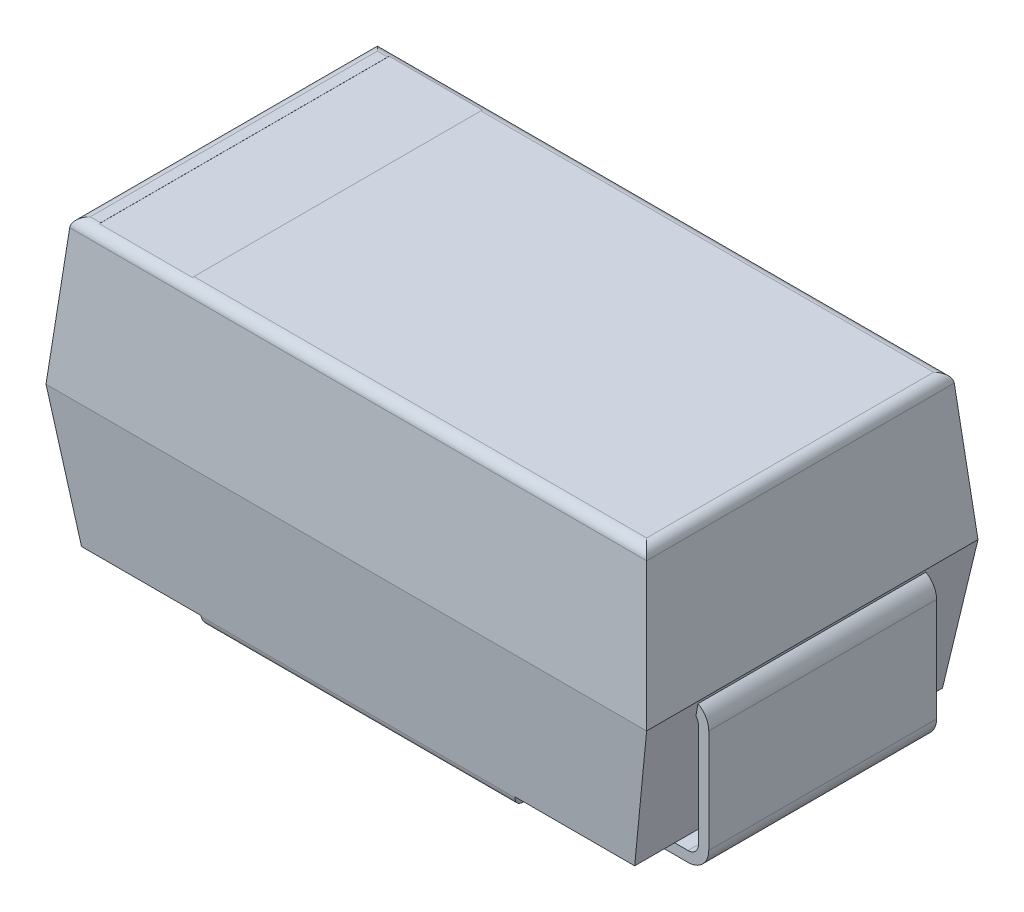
ISO-10303-21;
HEADER;
FILE_DESCRIPTION(('STEP AP214'),'2;1');
FILE_NAME('part.step','',(''),(''),'','','');
FILE_SCHEMA(('AUTOMOTIVE_DESIGN { 1 0 10303 214 1 1 1 1 }'));
ENDSEC;
DATA;
#1=APPLICATION_CONTEXT('core data for automotive mechanical design processes');
#2=APPLICATION_PROTOCOL_DEFINITION('international standard','automotive_design',2000,#1);
#3=PRODUCT_CONTEXT('',#1,'mechanical');
#4=PRODUCT('Part','Part','',(#3));
#5=PRODUCT_RELATED_PRODUCT_CATEGORY('part','',(#4));
#6=PRODUCT_DEFINITION_FORMATION('','',#4);
#7=PRODUCT_DEFINITION_CONTEXT('part definition',#1,'design');
#8=PRODUCT_DEFINITION('design','',#6,#7);
#9=PRODUCT_DEFINITION_SHAPE('','',#8);
#10=(LENGTH_UNIT() NAMED_UNIT(*) SI_UNIT(.MILLI.,.METRE.));
#11=(NAMED_UNIT(*) PLANE_ANGLE_UNIT() SI_UNIT($,.RADIAN.));
#12=(NAMED_UNIT(*) SI_UNIT($,.STERADIAN.) SOLID_ANGLE_UNIT());
#13=UNCERTAINTY_MEASURE_WITH_UNIT(LENGTH_MEASURE(1.E-05),#10,'distance_accuracy_value','');
#14=(GEOMETRIC_REPRESENTATION_CONTEXT(3) GLOBAL_UNCERTAINTY_ASSIGNED_CONTEXT((#13)) GLOBAL_UNIT_ASSIGNED_CONTEXT((#10,
#11,#12)) REPRESENTATION_CONTEXT('',''));
#15=CARTESIAN_POINT('',(0.,0.,0.));
#16=DIRECTION('',(0.,0.,1.));
#17=DIRECTION('',(1.,0.,0.));
#18=AXIS2_PLACEMENT_3D('',#15,#16,#17);
#19=CARTESIAN_POINT('',(2.68588275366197,2.8,1.6));
#20=DIRECTION('',(0.,-1.,0.));
#21=DIRECTION('',(0.,0.,-1.));
#22=AXIS2_PLACEMENT_3D('',#19,#20,#21);
#23=PLANE('',#22);
#24=DIRECTION('',(1.,0.,0.));
#25=VECTOR('',#24,1.);
#26=CARTESIAN_POINT('',(-3.,2.8,1.38588275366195));
#27=LINE('',#26,#25);
#28=CARTESIAN_POINT('',(-2.68588275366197,2.8,1.38588275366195));
#29=VERTEX_POINT('',#28);
#30=CARTESIAN_POINT('',(-2.58588275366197,2.8,1.38588275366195));
#31=VERTEX_POINT('',#30);
#32=EDGE_CURVE('E333',#29,#31,#27,.T.);
#33=ORIENTED_EDGE('',*,*,#32,.T.);
#34=DIRECTION('',(0.,0.,1.));
#35=VECTOR('',#34,1.);
#36=CARTESIAN_POINT('',(-2.58588275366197,2.8,-1.6));
#37=LINE('',#36,#35);
#38=CARTESIAN_POINT('',(-2.58588275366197,2.8,-1.38588275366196));
#39=VERTEX_POINT('',#38);
#40=EDGE_CURVE('E310',#39,#31,#37,.T.);
#41=ORIENTED_EDGE('',*,*,#40,.F.);
#42=DIRECTION('',(1.,0.,0.));
#43=VECTOR('',#42,1.);
#44=CARTESIAN_POINT('',(-3.,2.8,-1.38588275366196));
#45=LINE('',#44,#43);
#46=CARTESIAN_POINT('',(-2.68588275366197,2.8,-1.38588275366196));
#47=VERTEX_POINT('',#46);
#48=EDGE_CURVE('E337',#47,#39,#45,.T.);
#49=ORIENTED_EDGE('',*,*,#48,.F.);
#50=DIRECTION('',(0.,0.,-1.));
#51=VECTOR('',#50,1.);
#52=CARTESIAN_POINT('',(-2.68588275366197,2.8,1.6));
#53=LINE('',#52,#51);
#54=EDGE_CURVE('E396',#29,#47,#53,.T.);
#55=ORIENTED_EDGE('',*,*,#54,.F.);
#56=EDGE_LOOP('',(#33,#41,#49,#55));
#57=FACE_BOUND('',#56,.T.);
#58=ADVANCED_FACE('F34',(#57),#23,.F.);
#59=CARTESIAN_POINT('',(-2.9,1.4,1.6));
#60=DIRECTION('',(0.984807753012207,0.173648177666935,0.));
#61=DIRECTION('',(-0.173648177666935,0.984807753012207,0.));
#62=AXIS2_PLACEMENT_3D('',#59,#60,#61);
#63=PLANE('',#62);
#64=DIRECTION('',(0.,0.,-1.));
#65=VECTOR('',#64,1.);
#66=CARTESIAN_POINT('',(-2.89570064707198,1.37561715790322,1.1));
#67=LINE('',#66,#65);
#68=CARTESIAN_POINT('',(-2.89570064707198,1.37561715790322,-1.1));
#69=VERTEX_POINT('',#68);
#70=CARTESIAN_POINT('',(-2.89570064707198,1.37561715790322,1.1));
#71=VERTEX_POINT('',#70);
#72=EDGE_CURVE('E437',#69,#71,#67,.F.);
#73=ORIENTED_EDGE('',*,*,#72,.T.);
#74=DIRECTION('',(0.173648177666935,-0.984807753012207,0.));
#75=VECTOR('',#74,1.);
#76=CARTESIAN_POINT('',(-2.69177254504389,0.219083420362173,1.1));
#77=LINE('',#76,#75);
#78=CARTESIAN_POINT('',(-2.87616118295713,1.26480335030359,1.1));
#79=VERTEX_POINT('',#78);
#80=EDGE_CURVE('E441',#71,#79,#77,.T.);
#81=ORIENTED_EDGE('',*,*,#80,.T.);
#82=DIRECTION('',(0.,0.,-1.));
#83=VECTOR('',#82,1.);
#84=CARTESIAN_POINT('',(-2.87616118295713,1.26480335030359,1.1));
#85=LINE('',#84,#83);
#86=CARTESIAN_POINT('',(-2.87616118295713,1.26480335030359,-1.1));
#87=VERTEX_POINT('',#86);
#88=EDGE_CURVE('E439',#79,#87,#85,.T.);
#89=ORIENTED_EDGE('',*,*,#88,.T.);
#90=DIRECTION('',(0.173648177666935,-0.984807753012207,0.));
#91=VECTOR('',#90,1.);
#92=CARTESIAN_POINT('',(-2.69177254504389,0.219083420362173,-1.1));
#93=LINE('',#92,#91);
#94=EDGE_CURVE('E578',#69,#87,#93,.T.);
#95=ORIENTED_EDGE('',*,*,#94,.F.);
#96=EDGE_LOOP('',(#73,#81,#89,#95));
#97=FACE_BOUND('',#96,.T.);
#98=DIRECTION('',(-0.173007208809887,0.981172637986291,-0.0858414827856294));
#99=VECTOR('',#98,1.);
#100=CARTESIAN_POINT('',(-2.8524761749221,1.13047899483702,-1.57641996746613));
#101=LINE('',#100,#99);
#102=CARTESIAN_POINT('',(-2.67077492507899,0.0999999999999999,-1.48626473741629));
#103=VERTEX_POINT('',#102);
#104=CARTESIAN_POINT('',(-2.9,1.4,-1.6));
#105=VERTEX_POINT('',#104);
#106=EDGE_CURVE('E358',#103,#105,#101,.T.);
#107=ORIENTED_EDGE('',*,*,#106,.F.);
#108=DIRECTION('',(0.,0.,-1.));
#109=VECTOR('',#108,1.);
#110=CARTESIAN_POINT('',(-2.67077492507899,0.0999999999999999,1.6));
#111=LINE('',#110,#109);
#112=CARTESIAN_POINT('',(-2.67077492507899,0.0999999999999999,-1.1));
#113=VERTEX_POINT('',#112);
#114=EDGE_CURVE('E424',#113,#103,#111,.T.);
#115=ORIENTED_EDGE('',*,*,#114,.F.);
#116=CARTESIAN_POINT('',(-2.67077492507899,0.0999999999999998,1.1));
#117=VERTEX_POINT('',#116);
#118=EDGE_CURVE('E428',#117,#113,#111,.T.);
#119=ORIENTED_EDGE('',*,*,#118,.F.);
#120=CARTESIAN_POINT('',(-2.67077492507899,0.0999999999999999,1.48626473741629));
#121=VERTEX_POINT('',#120);
#122=EDGE_CURVE('E425',#121,#117,#111,.T.);
#123=ORIENTED_EDGE('',*,*,#122,.F.);
#124=DIRECTION('',(0.173007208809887,-0.98117263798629,-0.085841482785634));
#125=VECTOR('',#124,1.);
#126=CARTESIAN_POINT('',(-2.9,1.4,1.6));
#127=LINE('',#126,#125);
#128=CARTESIAN_POINT('',(-2.9,1.4,1.6));
#129=VERTEX_POINT('',#128);
#130=EDGE_CURVE('E375',#129,#121,#127,.T.);
#131=ORIENTED_EDGE('',*,*,#130,.F.);
#132=DIRECTION('',(0.,0.,-1.));
#133=VECTOR('',#132,1.);
#134=CARTESIAN_POINT('',(-2.9,1.4,1.6));
#135=LINE('',#134,#133);
#136=EDGE_CURVE('E390',#129,#105,#135,.T.);
#137=ORIENTED_EDGE('',*,*,#136,.T.);
#138=EDGE_LOOP('',(#107,#115,#119,#123,#131,#137));
#139=FACE_BOUND('',#138,.T.);
#140=ADVANCED_FACE('F658',(#97,#139),#63,.F.);
#141=CARTESIAN_POINT('',(-2.67077492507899,0.0999999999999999,1.6));
#142=DIRECTION('',(0.,1.,0.));
#143=DIRECTION('',(-1.,0.,0.));
#144=AXIS2_PLACEMENT_3D('',#141,#142,#143);
#145=PLANE('',#144);
#146=DIRECTION('',(-1.,0.,0.));
#147=VECTOR('',#146,1.);
#148=CARTESIAN_POINT('',(-2.67077492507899,0.0999999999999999,-1.48626473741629));
#149=LINE('',#148,#147);
#150=CARTESIAN_POINT('',(-1.51763269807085,0.0999999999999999,-1.48626473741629));
#151=VERTEX_POINT('',#150);
#152=EDGE_CURVE('E356',#151,#103,#149,.T.);
#153=ORIENTED_EDGE('',*,*,#152,.F.);
#154=DIRECTION('',(0.,0.,-1.));
#155=VECTOR('',#154,1.);
#156=CARTESIAN_POINT('',(-1.51763269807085,0.0999999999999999,1.6));
#157=LINE('',#156,#155);
#158=CARTESIAN_POINT('',(-1.51763269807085,0.0999999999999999,1.48626473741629));
#159=VERTEX_POINT('',#158);
#160=EDGE_CURVE('E421',#159,#151,#157,.T.);
#161=ORIENTED_EDGE('',*,*,#160,.F.);
#162=DIRECTION('',(1.,0.,0.));
#163=VECTOR('',#162,1.);
#164=CARTESIAN_POINT('',(-2.67077492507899,0.0999999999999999,1.48626473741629));
#165=LINE('',#164,#163);
#166=EDGE_CURVE('E373',#121,#159,#165,.T.);
#167=ORIENTED_EDGE('',*,*,#166,.F.);
#168=ORIENTED_EDGE('',*,*,#122,.T.);
#169=DIRECTION('',(-1.,0.,0.));
#170=VECTOR('',#169,1.);
#171=CARTESIAN_POINT('',(-1.7,0.0999999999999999,1.1));
#172=LINE('',#171,#170);
#173=CARTESIAN_POINT('',(-1.7,0.0999999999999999,1.1));
#174=VERTEX_POINT('',#173);
#175=EDGE_CURVE('E448',#174,#117,#172,.T.);
#176=ORIENTED_EDGE('',*,*,#175,.F.);
#177=DIRECTION('',(0.,0.,-1.));
#178=VECTOR('',#177,1.);
#179=CARTESIAN_POINT('',(-1.7,0.0999999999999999,1.1));
#180=LINE('',#179,#178);
#181=CARTESIAN_POINT('',(-1.7,0.0999999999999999,-1.1));
#182=VERTEX_POINT('',#181);
#183=EDGE_CURVE('E572',#174,#182,#180,.T.);
#184=ORIENTED_EDGE('',*,*,#183,.T.);
#185=DIRECTION('',(-1.,0.,0.));
#186=VECTOR('',#185,1.);
#187=CARTESIAN_POINT('',(-1.7,0.0999999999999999,-1.1));
#188=LINE('',#187,#186);
#189=EDGE_CURVE('E490',#182,#113,#188,.T.);
#190=ORIENTED_EDGE('',*,*,#189,.T.);
#191=ORIENTED_EDGE('',*,*,#114,.T.);
#192=EDGE_LOOP('',(#153,#161,#167,#168,#176,#184,#190,#191));
#193=FACE_BOUND('',#192,.T.);
#194=ADVANCED_FACE('F652',(#193),#145,.F.);
#195=CARTESIAN_POINT('',(2.67077492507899,0.0999999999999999,1.6));
#196=DIRECTION('',(0.,1.,0.));
#197=DIRECTION('',(-1.,0.,0.));
#198=AXIS2_PLACEMENT_3D('',#195,#196,#197);
#199=PLANE('',#198);
#200=DIRECTION('',(-1.,0.,0.));
#201=VECTOR('',#200,1.);
#202=CARTESIAN_POINT('',(2.67077492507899,0.0999999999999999,-1.48626473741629));
#203=LINE('',#202,#201);
#204=CARTESIAN_POINT('',(2.67077492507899,0.0999999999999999,-1.48626473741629));
#205=VERTEX_POINT('',#204);
#206=CARTESIAN_POINT('',(1.51763269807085,0.0999999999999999,-1.48626473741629));
#207=VERTEX_POINT('',#206);
#208=EDGE_CURVE('E350',#205,#207,#203,.T.);
#209=ORIENTED_EDGE('',*,*,#208,.F.);
#210=DIRECTION('',(0.,0.,-1.));
#211=VECTOR('',#210,1.);
#212=CARTESIAN_POINT('',(2.67077492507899,0.0999999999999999,1.6));
#213=LINE('',#212,#211);
#214=CARTESIAN_POINT('',(2.67077492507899,0.0999999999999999,-1.1));
#215=VERTEX_POINT('',#214);
#216=EDGE_CURVE('E408',#215,#205,#213,.T.);
#217=ORIENTED_EDGE('',*,*,#216,.F.);
#218=DIRECTION('',(-1.,0.,0.));
#219=VECTOR('',#218,1.);
#220=CARTESIAN_POINT('',(1.7,0.0999999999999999,-1.1));
#221=LINE('',#220,#219);
#222=CARTESIAN_POINT('',(1.7,0.0999999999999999,-1.1));
#223=VERTEX_POINT('',#222);
#224=EDGE_CURVE('E506',#215,#223,#221,.T.);
#225=ORIENTED_EDGE('',*,*,#224,.T.);
#226=DIRECTION('',(0.,0.,-1.));
#227=VECTOR('',#226,1.);
#228=CARTESIAN_POINT('',(1.7,0.0999999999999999,1.1));
#229=LINE('',#228,#227);
#230=CARTESIAN_POINT('',(1.7,0.0999999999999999,1.1));
#231=VERTEX_POINT('',#230);
#232=EDGE_CURVE('E551',#231,#223,#229,.T.);
#233=ORIENTED_EDGE('',*,*,#232,.F.);
#234=DIRECTION('',(1.,0.,0.));
#235=VECTOR('',#234,1.);
#236=CARTESIAN_POINT('',(-2.8,0.0999999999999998,1.1));
#237=LINE('',#236,#235);
#238=CARTESIAN_POINT('',(2.67077492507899,0.0999999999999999,1.1));
#239=VERTEX_POINT('',#238);
#240=EDGE_CURVE('E434',#231,#239,#237,.T.);
#241=ORIENTED_EDGE('',*,*,#240,.T.);
#242=CARTESIAN_POINT('',(2.67077492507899,0.0999999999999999,1.48626473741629));
#243=VERTEX_POINT('',#242);
#244=EDGE_CURVE('E409',#243,#239,#213,.T.);
#245=ORIENTED_EDGE('',*,*,#244,.F.);
#246=DIRECTION('',(1.,0.,0.));
#247=VECTOR('',#246,1.);
#248=CARTESIAN_POINT('',(2.67077492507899,0.0999999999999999,1.48626473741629));
#249=LINE('',#248,#247);
#250=CARTESIAN_POINT('',(1.51763269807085,0.0999999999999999,1.48626473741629));
#251=VERTEX_POINT('',#250);
#252=EDGE_CURVE('E367',#251,#243,#249,.T.);
#253=ORIENTED_EDGE('',*,*,#252,.F.);
#254=DIRECTION('',(0.,0.,-1.));
#255=VECTOR('',#254,1.);
#256=CARTESIAN_POINT('',(1.51763269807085,0.0999999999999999,1.6));
#257=LINE('',#256,#255);
#258=EDGE_CURVE('E411',#251,#207,#257,.T.);
#259=ORIENTED_EDGE('',*,*,#258,.T.);
#260=EDGE_LOOP('',(#209,#217,#225,#233,#241,#245,#253,#259));
#261=FACE_BOUND('',#260,.T.);
#262=ADVANCED_FACE('F621',(#261),#199,.F.);
#263=CARTESIAN_POINT('',(2.9,1.4,1.6));
#264=DIRECTION('',(-0.984807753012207,0.173648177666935,0.));
#265=DIRECTION('',(-0.173648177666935,-0.984807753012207,0.));
#266=AXIS2_PLACEMENT_3D('',#263,#264,#265);
#267=PLANE('',#266);
#268=DIRECTION('',(0.,0.,-1.));
#269=VECTOR('',#268,1.);
#270=CARTESIAN_POINT('',(2.87616118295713,1.26480335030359,1.1));
#271=LINE('',#270,#269);
#272=CARTESIAN_POINT('',(2.87616118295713,1.26480335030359,-1.1));
#273=VERTEX_POINT('',#272);
#274=CARTESIAN_POINT('',(2.87616118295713,1.26480335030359,1.1));
#275=VERTEX_POINT('',#274);
#276=EDGE_CURVE('E430',#273,#275,#271,.F.);
#277=ORIENTED_EDGE('',*,*,#276,.T.);
#278=DIRECTION('',(0.173648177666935,0.984807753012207,0.));
#279=VECTOR('',#278,1.);
#280=CARTESIAN_POINT('',(2.52291188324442,-0.738572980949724,1.1));
#281=LINE('',#280,#279);
#282=CARTESIAN_POINT('',(2.89570064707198,1.37561715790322,1.1));
#283=VERTEX_POINT('',#282);
#284=EDGE_CURVE('E432',#275,#283,#281,.T.);
#285=ORIENTED_EDGE('',*,*,#284,.T.);
#286=DIRECTION('',(0.,0.,-1.));
#287=VECTOR('',#286,1.);
#288=CARTESIAN_POINT('',(2.89570064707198,1.37561715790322,1.1));
#289=LINE('',#288,#287);
#290=CARTESIAN_POINT('',(2.89570064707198,1.37561715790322,-1.1));
#291=VERTEX_POINT('',#290);
#292=EDGE_CURVE('E427',#283,#291,#289,.T.);
#293=ORIENTED_EDGE('',*,*,#292,.T.);
#294=DIRECTION('',(0.173648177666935,0.984807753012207,0.));
#295=VECTOR('',#294,1.);
#296=CARTESIAN_POINT('',(2.52291188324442,-0.738572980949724,-1.1));
#297=LINE('',#296,#295);
#298=EDGE_CURVE('E575',#273,#291,#297,.T.);
#299=ORIENTED_EDGE('',*,*,#298,.F.);
#300=EDGE_LOOP('',(#277,#285,#293,#299));
#301=FACE_BOUND('',#300,.T.);
#302=DIRECTION('',(-0.173007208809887,-0.981172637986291,0.0858414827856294));
#303=VECTOR('',#302,1.);
#304=CARTESIAN_POINT('',(2.8524761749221,1.13047899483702,-1.57641996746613));
#305=LINE('',#304,#303);
#306=CARTESIAN_POINT('',(2.9,1.4,-1.6));
#307=VERTEX_POINT('',#306);
#308=EDGE_CURVE('E352',#307,#205,#305,.T.);
#309=ORIENTED_EDGE('',*,*,#308,.F.);
#310=DIRECTION('',(0.,0.,-1.));
#311=VECTOR('',#310,1.);
#312=CARTESIAN_POINT('',(2.9,1.4,1.6));
#313=LINE('',#312,#311);
#314=CARTESIAN_POINT('',(2.9,1.4,1.6));
#315=VERTEX_POINT('',#314);
#316=EDGE_CURVE('E405',#315,#307,#313,.T.);
#317=ORIENTED_EDGE('',*,*,#316,.F.);
#318=DIRECTION('',(0.173007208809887,0.98117263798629,0.085841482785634));
#319=VECTOR('',#318,1.);
#320=CARTESIAN_POINT('',(2.9,1.4,1.6));
#321=LINE('',#320,#319);
#322=EDGE_CURVE('E369',#243,#315,#321,.T.);
#323=ORIENTED_EDGE('',*,*,#322,.F.);
#324=ORIENTED_EDGE('',*,*,#244,.T.);
#325=EDGE_CURVE('E412',#239,#215,#213,.T.);
#326=ORIENTED_EDGE('',*,*,#325,.T.);
#327=ORIENTED_EDGE('',*,*,#216,.T.);
#328=EDGE_LOOP('',(#309,#317,#323,#324,#326,#327));
#329=FACE_BOUND('',#328,.T.);
#330=ADVANCED_FACE('F611',(#301,#329),#267,.F.);
#331=CARTESIAN_POINT('',(-1.51763269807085,0.0999999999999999,1.6));
#332=DIRECTION('',(0.984807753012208,0.173648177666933,0.));
#333=DIRECTION('',(-0.173648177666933,0.984807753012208,0.));
#334=AXIS2_PLACEMENT_3D('',#331,#332,#333);
#335=PLANE('',#334);
#336=DIRECTION('',(-0.173007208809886,0.981172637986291,-0.0858414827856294));
#337=VECTOR('',#336,1.);
#338=CARTESIAN_POINT('',(-1.47179797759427,-0.159941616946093,-1.46352279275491));
#339=LINE('',#338,#337);
#340=CARTESIAN_POINT('',(-1.51609590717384,0.0912844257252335,-1.48550222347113));
#341=VERTEX_POINT('',#340);
#342=EDGE_CURVE('E354',#341,#151,#339,.T.);
#343=ORIENTED_EDGE('',*,*,#342,.F.);
#344=CARTESIAN_POINT('',(-1.51763269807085,0.0999999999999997,-1.38588275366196));
#345=DIRECTION('',(0.984807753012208,0.173648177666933,0.));
#346=DIRECTION('',(0.173648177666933,-0.984807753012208,0.));
#347=AXIS2_PLACEMENT_3D('',#344,#345,#346);
#348=ELLIPSE('',#347,0.101542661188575,0.1);
#349=CARTESIAN_POINT('',(-1.5,0.,-1.38588275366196));
#350=VERTEX_POINT('',#349);
#351=EDGE_CURVE('E388',#350,#341,#348,.T.);
#352=ORIENTED_EDGE('',*,*,#351,.F.);
#353=DIRECTION('',(0.,0.,-1.));
#354=VECTOR('',#353,1.);
#355=CARTESIAN_POINT('',(-1.5,0.,1.6));
#356=LINE('',#355,#354);
#357=CARTESIAN_POINT('',(-1.5,0.,1.38588275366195));
#358=VERTEX_POINT('',#357);
#359=EDGE_CURVE('E418',#358,#350,#356,.T.);
#360=ORIENTED_EDGE('',*,*,#359,.F.);
#361=CARTESIAN_POINT('',(-1.51763269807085,0.0999999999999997,1.38588275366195));
#362=DIRECTION('',(0.984807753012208,0.173648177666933,0.));
#363=DIRECTION('',(0.173648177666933,-0.984807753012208,0.));
#364=AXIS2_PLACEMENT_3D('',#361,#362,#363);
#365=ELLIPSE('',#364,0.101542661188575,0.1);
#366=CARTESIAN_POINT('',(-1.51609590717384,0.0912844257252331,1.48550222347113));
#367=VERTEX_POINT('',#366);
#368=EDGE_CURVE('E386',#367,#358,#365,.T.);
#369=ORIENTED_EDGE('',*,*,#368,.F.);
#370=DIRECTION('',(0.173007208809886,-0.98117263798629,-0.085841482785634));
#371=VECTOR('',#370,1.);
#372=CARTESIAN_POINT('',(-1.51932180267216,0.109579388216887,1.48710282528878));
#373=LINE('',#372,#371);
#374=EDGE_CURVE('E371',#159,#367,#373,.T.);
#375=ORIENTED_EDGE('',*,*,#374,.F.);
#376=ORIENTED_EDGE('',*,*,#160,.T.);
#377=EDGE_LOOP('',(#343,#352,#360,#369,#375,#376));
#378=FACE_BOUND('',#377,.T.);
#379=ADVANCED_FACE('F637',(#378),#335,.F.);
#380=CARTESIAN_POINT('',(-1.5,0.,1.6));
#381=DIRECTION('',(0.,1.,0.));
#382=DIRECTION('',(0.,0.,1.));
#383=AXIS2_PLACEMENT_3D('',#380,#381,#382);
#384=PLANE('',#383);
#385=ORIENTED_EDGE('',*,*,#359,.T.);
#386=DIRECTION('',(1.,0.,0.));
#387=VECTOR('',#386,1.);
#388=CARTESIAN_POINT('',(-3.,0.,-1.38588275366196));
#389=LINE('',#388,#387);
#390=CARTESIAN_POINT('',(1.5,0.,-1.38588275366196));
#391=VERTEX_POINT('',#390);
#392=EDGE_CURVE('E321',#350,#391,#389,.T.);
#393=ORIENTED_EDGE('',*,*,#392,.T.);
#394=DIRECTION('',(0.,0.,-1.));
#395=VECTOR('',#394,1.);
#396=CARTESIAN_POINT('',(1.5,0.,1.6));
#397=LINE('',#396,#395);
#398=CARTESIAN_POINT('',(1.5,0.,1.38588275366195));
#399=VERTEX_POINT('',#398);
#400=EDGE_CURVE('E415',#399,#391,#397,.T.);
#401=ORIENTED_EDGE('',*,*,#400,.F.);
#402=DIRECTION('',(1.,0.,0.));
#403=VECTOR('',#402,1.);
#404=CARTESIAN_POINT('',(-3.,0.,1.38588275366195));
#405=LINE('',#404,#403);
#406=EDGE_CURVE('E324',#358,#399,#405,.T.);
#407=ORIENTED_EDGE('',*,*,#406,.F.);
#408=EDGE_LOOP('',(#385,#393,#401,#407));
#409=FACE_BOUND('',#408,.T.);
#410=ADVANCED_FACE('F641',(#409),#384,.F.);
#411=CARTESIAN_POINT('',(1.51763269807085,0.0999999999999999,1.6));
#412=DIRECTION('',(-0.984807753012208,0.173648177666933,0.));
#413=DIRECTION('',(-0.173648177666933,-0.984807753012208,0.));
#414=AXIS2_PLACEMENT_3D('',#411,#412,#413);
#415=PLANE('',#414);
#416=DIRECTION('',(-0.173007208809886,-0.981172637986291,0.0858414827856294));
#417=VECTOR('',#416,1.);
#418=CARTESIAN_POINT('',(1.47179797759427,-0.159941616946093,-1.46352279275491));
#419=LINE('',#418,#417);
#420=CARTESIAN_POINT('',(1.51609590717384,0.0912844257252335,-1.48550222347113));
#421=VERTEX_POINT('',#420);
#422=EDGE_CURVE('E348',#207,#421,#419,.T.);
#423=ORIENTED_EDGE('',*,*,#422,.F.);
#424=ORIENTED_EDGE('',*,*,#258,.F.);
#425=DIRECTION('',(0.173007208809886,0.98117263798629,0.085841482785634));
#426=VECTOR('',#425,1.);
#427=CARTESIAN_POINT('',(1.51932180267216,0.109579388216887,1.48710282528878));
#428=LINE('',#427,#426);
#429=CARTESIAN_POINT('',(1.51609590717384,0.0912844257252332,1.48550222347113));
#430=VERTEX_POINT('',#429);
#431=EDGE_CURVE('E365',#430,#251,#428,.T.);
#432=ORIENTED_EDGE('',*,*,#431,.F.);
#433=CARTESIAN_POINT('',(1.51763269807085,0.0999999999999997,1.38588275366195));
#434=DIRECTION('',(-0.984807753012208,0.173648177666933,0.));
#435=DIRECTION('',(0.173648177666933,0.984807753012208,0.));
#436=AXIS2_PLACEMENT_3D('',#433,#434,#435);
#437=ELLIPSE('',#436,0.101542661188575,0.1);
#438=EDGE_CURVE('E581',#399,#430,#437,.T.);
#439=ORIENTED_EDGE('',*,*,#438,.F.);
#440=ORIENTED_EDGE('',*,*,#400,.T.);
#441=CARTESIAN_POINT('',(1.51763269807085,0.0999999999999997,-1.38588275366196));
#442=DIRECTION('',(-0.984807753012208,0.173648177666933,0.));
#443=DIRECTION('',(0.173648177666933,0.984807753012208,0.));
#444=AXIS2_PLACEMENT_3D('',#441,#442,#443);
#445=ELLIPSE('',#444,0.101542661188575,0.1);
#446=EDGE_CURVE('E583',#421,#391,#445,.T.);
#447=ORIENTED_EDGE('',*,*,#446,.F.);
#448=EDGE_LOOP('',(#423,#424,#432,#439,#440,#447));
#449=FACE_BOUND('',#448,.T.);
#450=ADVANCED_FACE('F627',(#449),#415,.F.);
#451=CARTESIAN_POINT('',(2.78550222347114,2.70871557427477,1.6));
#452=DIRECTION('',(-0.996194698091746,-0.0871557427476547,0.));
#453=DIRECTION('',(0.0871557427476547,-0.996194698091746,0.));
#454=AXIS2_PLACEMENT_3D('',#451,#452,#453);
#455=PLANE('',#454);
#456=DIRECTION('',(-0.0868265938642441,0.992432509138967,-0.0868265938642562));
#457=VECTOR('',#456,1.);
#458=CARTESIAN_POINT('',(2.78636540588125,2.69884935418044,1.48636540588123));
#459=LINE('',#458,#457);
#460=CARTESIAN_POINT('',(2.78550222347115,2.70871557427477,1.48550222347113));
#461=VERTEX_POINT('',#460);
#462=EDGE_CURVE('E363',#315,#461,#459,.T.);
#463=ORIENTED_EDGE('',*,*,#462,.F.);
#464=ORIENTED_EDGE('',*,*,#316,.T.);
#465=DIRECTION('',(0.0868265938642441,-0.992432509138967,-0.0868265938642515));
#466=VECTOR('',#465,1.);
#467=CARTESIAN_POINT('',(2.76224106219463,2.97459186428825,-1.46224106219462));
#468=LINE('',#467,#466);
#469=CARTESIAN_POINT('',(2.78550222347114,2.70871557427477,-1.48550222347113));
#470=VERTEX_POINT('',#469);
#471=EDGE_CURVE('E346',#470,#307,#468,.T.);
#472=ORIENTED_EDGE('',*,*,#471,.F.);
#473=DIRECTION('',(0.,0.,-1.));
#474=VECTOR('',#473,1.);
#475=CARTESIAN_POINT('',(2.78550222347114,2.70871557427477,1.6));
#476=LINE('',#475,#474);
#477=EDGE_CURVE('E402',#461,#470,#476,.T.);
#478=ORIENTED_EDGE('',*,*,#477,.F.);
#479=EDGE_LOOP('',(#463,#464,#472,#478));
#480=FACE_BOUND('',#479,.T.);
#481=ADVANCED_FACE('F606',(#480),#455,.F.);
#482=CARTESIAN_POINT('',(2.68588275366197,2.7,1.6));
#483=DIRECTION('',(0.,0.,-1.));
#484=DIRECTION('',(-1.,0.,0.));
#485=AXIS2_PLACEMENT_3D('',#482,#483,#484);
#486=CYLINDRICAL_SURFACE('',#485,0.0999999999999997);
#487=CARTESIAN_POINT('',(2.68588275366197,2.7,1.38588275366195));
#488=DIRECTION('',(0.707106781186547,0.,-0.707106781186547));
#489=DIRECTION('',(-0.707106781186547,0.,-0.707106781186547));
#490=AXIS2_PLACEMENT_3D('',#487,#488,#489);
#491=ELLIPSE('',#490,0.14142135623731,0.1);
#492=CARTESIAN_POINT('',(2.68588275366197,2.8,1.38588275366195));
#493=VERTEX_POINT('',#492);
#494=EDGE_CURVE('E383',#461,#493,#491,.F.);
#495=ORIENTED_EDGE('',*,*,#494,.F.);
#496=ORIENTED_EDGE('',*,*,#477,.T.);
#497=CARTESIAN_POINT('',(2.68588275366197,2.7,-1.38588275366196));
#498=DIRECTION('',(-0.707106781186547,0.,-0.707106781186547));
#499=DIRECTION('',(0.707106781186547,0.,-0.707106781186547));
#500=AXIS2_PLACEMENT_3D('',#497,#498,#499);
#501=ELLIPSE('',#500,0.141421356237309,0.0999999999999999);
#502=CARTESIAN_POINT('',(2.68588275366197,2.8,-1.38588275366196));
#503=VERTEX_POINT('',#502);
#504=EDGE_CURVE('E379',#503,#470,#501,.T.);
#505=ORIENTED_EDGE('',*,*,#504,.F.);
#506=DIRECTION('',(0.,0.,-1.));
#507=VECTOR('',#506,1.);
#508=CARTESIAN_POINT('',(2.68588275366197,2.8,1.6));
#509=LINE('',#508,#507);
#510=EDGE_CURVE('E399',#493,#503,#509,.T.);
#511=ORIENTED_EDGE('',*,*,#510,.F.);
#512=EDGE_LOOP('',(#495,#496,#505,#511));
#513=FACE_BOUND('',#512,.T.);
#514=ADVANCED_FACE('F597',(#513),#486,.T.);
#515=CARTESIAN_POINT('',(-1.68588275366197,2.8,-1.38588275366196));
#516=VERTEX_POINT('',#515);
#517=EDGE_CURVE('E339',#516,#503,#45,.T.);
#518=ORIENTED_EDGE('',*,*,#517,.F.);
#519=DIRECTION('',(0.,0.,1.));
#520=VECTOR('',#519,1.);
#521=CARTESIAN_POINT('',(-1.68588275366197,2.8,-1.6));
#522=LINE('',#521,#520);
#523=CARTESIAN_POINT('',(-1.68588275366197,2.8,1.38588275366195));
#524=VERTEX_POINT('',#523);
#525=EDGE_CURVE('E296',#516,#524,#522,.T.);
#526=ORIENTED_EDGE('',*,*,#525,.T.);
#527=EDGE_CURVE('E336',#524,#493,#27,.T.);
#528=ORIENTED_EDGE('',*,*,#527,.T.);
#529=ORIENTED_EDGE('',*,*,#510,.T.);
#530=EDGE_LOOP('',(#518,#526,#528,#529));
#531=FACE_BOUND('',#530,.T.);
#532=ADVANCED_FACE('F588',(#531),#23,.F.);
#533=CARTESIAN_POINT('',(-2.68588275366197,2.7,1.6));
#534=DIRECTION('',(0.,0.,-1.));
#535=DIRECTION('',(-1.,0.,0.));
#536=AXIS2_PLACEMENT_3D('',#533,#534,#535);
#537=CYLINDRICAL_SURFACE('',#536,0.0999999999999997);
#538=CARTESIAN_POINT('',(-2.68588275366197,2.7,1.38588275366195));
#539=DIRECTION('',(-0.707106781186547,0.,-0.707106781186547));
#540=DIRECTION('',(0.707106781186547,0.,-0.707106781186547));
#541=AXIS2_PLACEMENT_3D('',#538,#539,#540);
#542=ELLIPSE('',#541,0.14142135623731,0.1);
#543=CARTESIAN_POINT('',(-2.78550222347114,2.70871557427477,1.48550222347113));
#544=VERTEX_POINT('',#543);
#545=EDGE_CURVE('E381',#29,#544,#542,.F.);
#546=ORIENTED_EDGE('',*,*,#545,.F.);
#547=ORIENTED_EDGE('',*,*,#54,.T.);
#548=CARTESIAN_POINT('',(-2.68588275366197,2.7,-1.38588275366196));
#549=DIRECTION('',(0.707106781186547,0.,-0.707106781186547));
#550=DIRECTION('',(-0.707106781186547,0.,-0.707106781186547));
#551=AXIS2_PLACEMENT_3D('',#548,#549,#550);
#552=ELLIPSE('',#551,0.141421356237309,0.0999999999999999);
#553=CARTESIAN_POINT('',(-2.78550222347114,2.70871557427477,-1.48550222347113));
#554=VERTEX_POINT('',#553);
#555=EDGE_CURVE('E377',#554,#47,#552,.T.);
#556=ORIENTED_EDGE('',*,*,#555,.F.);
#557=DIRECTION('',(0.,0.,-1.));
#558=VECTOR('',#557,1.);
#559=CARTESIAN_POINT('',(-2.78550222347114,2.70871557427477,1.6));
#560=LINE('',#559,#558);
#561=EDGE_CURVE('E393',#544,#554,#560,.T.);
#562=ORIENTED_EDGE('',*,*,#561,.F.);
#563=EDGE_LOOP('',(#546,#547,#556,#562));
#564=FACE_BOUND('',#563,.T.);
#565=ADVANCED_FACE('F668',(#564),#537,.T.);
#566=CARTESIAN_POINT('',(-2.78550222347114,2.70871557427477,1.6));
#567=DIRECTION('',(0.996194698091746,-0.0871557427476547,0.));
#568=DIRECTION('',(0.0871557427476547,0.996194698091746,0.));
#569=AXIS2_PLACEMENT_3D('',#566,#567,#568);
#570=PLANE('',#569);
#571=DIRECTION('',(-0.0868265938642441,-0.992432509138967,0.0868265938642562));
#572=VECTOR('',#571,1.);
#573=CARTESIAN_POINT('',(-2.78636540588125,2.69884935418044,1.48636540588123));
#574=LINE('',#573,#572);
#575=EDGE_CURVE('E361',#544,#129,#574,.T.);
#576=ORIENTED_EDGE('',*,*,#575,.F.);
#577=ORIENTED_EDGE('',*,*,#561,.T.);
#578=DIRECTION('',(0.0868265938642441,0.992432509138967,0.0868265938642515));
#579=VECTOR('',#578,1.);
#580=CARTESIAN_POINT('',(-2.76224106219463,2.97459186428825,-1.46224106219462));
#581=LINE('',#580,#579);
#582=EDGE_CURVE('E320',#105,#554,#581,.T.);
#583=ORIENTED_EDGE('',*,*,#582,.F.);
#584=ORIENTED_EDGE('',*,*,#136,.F.);
#585=EDGE_LOOP('',(#576,#577,#583,#584));
#586=FACE_BOUND('',#585,.T.);
#587=ADVANCED_FACE('F664',(#586),#570,.F.);
#588=CARTESIAN_POINT('',(-1.7,0.0999999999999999,1.1));
#589=DIRECTION('',(0.,-1.,0.));
#590=DIRECTION('',(1.,0.,0.));
#591=AXIS2_PLACEMENT_3D('',#588,#589,#590);
#592=PLANE('',#591);
#593=ORIENTED_EDGE('',*,*,#118,.T.);
#594=CARTESIAN_POINT('',(-2.8,0.0999999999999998,-1.1));
#595=VERTEX_POINT('',#594);
#596=EDGE_CURVE('E489',#113,#595,#188,.T.);
#597=ORIENTED_EDGE('',*,*,#596,.T.);
#598=DIRECTION('',(0.,0.,-1.));
#599=VECTOR('',#598,1.);
#600=CARTESIAN_POINT('',(-2.8,0.0999999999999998,1.1));
#601=LINE('',#600,#599);
#602=CARTESIAN_POINT('',(-2.8,0.0999999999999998,1.1));
#603=VERTEX_POINT('',#602);
#604=EDGE_CURVE('E569',#603,#595,#601,.T.);
#605=ORIENTED_EDGE('',*,*,#604,.F.);
#606=EDGE_CURVE('E446',#117,#603,#172,.T.);
#607=ORIENTED_EDGE('',*,*,#606,.F.);
#608=EDGE_LOOP('',(#593,#597,#605,#607));
#609=FACE_BOUND('',#608,.T.);
#610=ADVANCED_FACE('F785',(#609),#592,.F.);
#611=CARTESIAN_POINT('',(-2.8,1.2,1.1));
#612=DIRECTION('',(0.,0.,-1.));
#613=DIRECTION('',(-1.,0.,0.));
#614=AXIS2_PLACEMENT_3D('',#611,#612,#613);
#615=CYLINDRICAL_SURFACE('',#614,0.1);
#616=ORIENTED_EDGE('',*,*,#88,.F.);
#617=CARTESIAN_POINT('',(-2.8,1.2,1.1));
#618=DIRECTION('',(0.,0.,-1.));
#619=DIRECTION('',(-1.,0.,0.));
#620=AXIS2_PLACEMENT_3D('',#617,#618,#619);
#621=CIRCLE('',#620,0.1);
#622=CARTESIAN_POINT('',(-2.9,1.2,1.1));
#623=VERTEX_POINT('',#622);
#624=EDGE_CURVE('E455',#623,#79,#621,.T.);
#625=ORIENTED_EDGE('',*,*,#624,.F.);
#626=DIRECTION('',(0.,0.,-1.));
#627=VECTOR('',#626,1.);
#628=CARTESIAN_POINT('',(-2.9,1.2,1.1));
#629=LINE('',#628,#627);
#630=CARTESIAN_POINT('',(-2.9,1.2,-1.1));
#631=VERTEX_POINT('',#630);
#632=EDGE_CURVE('E563',#623,#631,#629,.T.);
#633=ORIENTED_EDGE('',*,*,#632,.T.);
#634=CARTESIAN_POINT('',(-2.8,1.2,-1.1));
#635=DIRECTION('',(0.,0.,-1.));
#636=DIRECTION('',(-1.,0.,0.));
#637=AXIS2_PLACEMENT_3D('',#634,#635,#636);
#638=CIRCLE('',#637,0.1);
#639=EDGE_CURVE('E497',#631,#87,#638,.T.);
#640=ORIENTED_EDGE('',*,*,#639,.T.);
#641=EDGE_LOOP('',(#616,#625,#633,#640));
#642=FACE_BOUND('',#641,.T.);
#643=ADVANCED_FACE('F746',(#642),#615,.F.);
#644=CARTESIAN_POINT('',(-2.8,1.2,1.1));
#645=DIRECTION('',(0.,0.,-1.));
#646=DIRECTION('',(-1.,0.,0.));
#647=AXIS2_PLACEMENT_3D('',#644,#645,#646);
#648=CYLINDRICAL_SURFACE('',#647,0.2);
#649=ORIENTED_EDGE('',*,*,#72,.F.);
#650=CARTESIAN_POINT('',(-2.8,1.2,-1.1));
#651=DIRECTION('',(0.,0.,1.));
#652=DIRECTION('',(-1.,0.,0.));
#653=AXIS2_PLACEMENT_3D('',#650,#651,#652);
#654=CIRCLE('',#653,0.2);
#655=CARTESIAN_POINT('',(-3.,1.2,-1.1));
#656=VERTEX_POINT('',#655);
#657=EDGE_CURVE('E521',#69,#656,#654,.T.);
#658=ORIENTED_EDGE('',*,*,#657,.T.);
#659=DIRECTION('',(0.,0.,-1.));
#660=VECTOR('',#659,1.);
#661=CARTESIAN_POINT('',(-3.,1.2,1.1));
#662=LINE('',#661,#660);
#663=CARTESIAN_POINT('',(-3.,1.2,1.1));
#664=VERTEX_POINT('',#663);
#665=EDGE_CURVE('E536',#664,#656,#662,.T.);
#666=ORIENTED_EDGE('',*,*,#665,.F.);
#667=CARTESIAN_POINT('',(-2.8,1.2,1.1));
#668=DIRECTION('',(0.,0.,1.));
#669=DIRECTION('',(-1.,0.,0.));
#670=AXIS2_PLACEMENT_3D('',#667,#668,#669);
#671=CIRCLE('',#670,0.2);
#672=EDGE_CURVE('E478',#71,#664,#671,.T.);
#673=ORIENTED_EDGE('',*,*,#672,.F.);
#674=EDGE_LOOP('',(#649,#658,#666,#673));
#675=FACE_BOUND('',#674,.T.);
#676=ADVANCED_FACE('F723',(#675),#648,.T.);
#677=CARTESIAN_POINT('',(-2.8,0.2,1.1));
#678=DIRECTION('',(0.,0.,-1.));
#679=DIRECTION('',(-1.,0.,0.));
#680=AXIS2_PLACEMENT_3D('',#677,#678,#679);
#681=PLANE('',#680);
#682=ORIENTED_EDGE('',*,*,#80,.F.);
#683=ORIENTED_EDGE('',*,*,#672,.T.);
#684=DIRECTION('',(0.,-1.,0.));
#685=VECTOR('',#684,1.);
#686=CARTESIAN_POINT('',(-3.,0.2,1.1));
#687=LINE('',#686,#685);
#688=CARTESIAN_POINT('',(-3.,0.2,1.1));
#689=VERTEX_POINT('',#688);
#690=EDGE_CURVE('E480',#664,#689,#687,.T.);
#691=ORIENTED_EDGE('',*,*,#690,.T.);
#692=CARTESIAN_POINT('',(-2.8,0.2,1.1));
#693=DIRECTION('',(0.,0.,1.));
#694=DIRECTION('',(-1.,0.,0.));
#695=AXIS2_PLACEMENT_3D('',#692,#693,#694);
#696=CIRCLE('',#695,0.2);
#697=CARTESIAN_POINT('',(-2.8,0.,1.1));
#698=VERTEX_POINT('',#697);
#699=EDGE_CURVE('E482',#689,#698,#696,.T.);
#700=ORIENTED_EDGE('',*,*,#699,.T.);
#701=DIRECTION('',(1.,0.,0.));
#702=VECTOR('',#701,1.);
#703=CARTESIAN_POINT('',(-1.7,0.,1.1));
#704=LINE('',#703,#702);
#705=CARTESIAN_POINT('',(-1.7,0.,1.1));
#706=VERTEX_POINT('',#705);
#707=EDGE_CURVE('E484',#698,#706,#704,.T.);
#708=ORIENTED_EDGE('',*,*,#707,.T.);
#709=DIRECTION('',(0.,1.,0.));
#710=VECTOR('',#709,1.);
#711=CARTESIAN_POINT('',(-1.7,0.,1.1));
#712=LINE('',#711,#710);
#713=EDGE_CURVE('E444',#706,#174,#712,.T.);
#714=ORIENTED_EDGE('',*,*,#713,.T.);
#715=ORIENTED_EDGE('',*,*,#175,.T.);
#716=ORIENTED_EDGE('',*,*,#606,.T.);
#717=CARTESIAN_POINT('',(-2.8,0.2,1.1));
#718=DIRECTION('',(0.,0.,-1.));
#719=DIRECTION('',(-1.,0.,0.));
#720=AXIS2_PLACEMENT_3D('',#717,#718,#719);
#721=CIRCLE('',#720,0.0999999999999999);
#722=CARTESIAN_POINT('',(-2.9,0.2,1.1));
#723=VERTEX_POINT('',#722);
#724=EDGE_CURVE('E451',#603,#723,#721,.T.);
#725=ORIENTED_EDGE('',*,*,#724,.T.);
#726=DIRECTION('',(0.,1.,0.));
#727=VECTOR('',#726,1.);
#728=CARTESIAN_POINT('',(-2.9,0.2,1.1));
#729=LINE('',#728,#727);
#730=EDGE_CURVE('E453',#723,#623,#729,.T.);
#731=ORIENTED_EDGE('',*,*,#730,.T.);
#732=ORIENTED_EDGE('',*,*,#624,.T.);
#733=EDGE_LOOP('',(#682,#683,#691,#700,#708,#714,#715,#716,#725,#731,#732));
#734=FACE_BOUND('',#733,.T.);
#735=ADVANCED_FACE('F719',(#734),#681,.F.);
#736=CARTESIAN_POINT('',(-2.8,0.2,-1.1));
#737=DIRECTION('',(0.,0.,-1.));
#738=DIRECTION('',(-1.,0.,0.));
#739=AXIS2_PLACEMENT_3D('',#736,#737,#738);
#740=PLANE('',#739);
#741=ORIENTED_EDGE('',*,*,#657,.F.);
#742=ORIENTED_EDGE('',*,*,#94,.T.);
#743=ORIENTED_EDGE('',*,*,#639,.F.);
#744=DIRECTION('',(0.,1.,0.));
#745=VECTOR('',#744,1.);
#746=CARTESIAN_POINT('',(-2.9,0.2,-1.1));
#747=LINE('',#746,#745);
#748=CARTESIAN_POINT('',(-2.9,0.2,-1.1));
#749=VERTEX_POINT('',#748);
#750=EDGE_CURVE('E495',#749,#631,#747,.T.);
#751=ORIENTED_EDGE('',*,*,#750,.F.);
#752=CARTESIAN_POINT('',(-2.8,0.2,-1.1));
#753=DIRECTION('',(0.,0.,-1.));
#754=DIRECTION('',(-1.,0.,0.));
#755=AXIS2_PLACEMENT_3D('',#752,#753,#754);
#756=CIRCLE('',#755,0.0999999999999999);
#757=EDGE_CURVE('E493',#595,#749,#756,.T.);
#758=ORIENTED_EDGE('',*,*,#757,.F.);
#759=ORIENTED_EDGE('',*,*,#596,.F.);
#760=ORIENTED_EDGE('',*,*,#189,.F.);
#761=DIRECTION('',(0.,1.,0.));
#762=VECTOR('',#761,1.);
#763=CARTESIAN_POINT('',(-1.7,0.,-1.1));
#764=LINE('',#763,#762);
#765=CARTESIAN_POINT('',(-1.7,0.,-1.1));
#766=VERTEX_POINT('',#765);
#767=EDGE_CURVE('E443',#766,#182,#764,.T.);
#768=ORIENTED_EDGE('',*,*,#767,.F.);
#769=DIRECTION('',(1.,0.,0.));
#770=VECTOR('',#769,1.);
#771=CARTESIAN_POINT('',(-1.7,0.,-1.1));
#772=LINE('',#771,#770);
#773=CARTESIAN_POINT('',(-2.8,0.,-1.1));
#774=VERTEX_POINT('',#773);
#775=EDGE_CURVE('E447',#774,#766,#772,.T.);
#776=ORIENTED_EDGE('',*,*,#775,.F.);
#777=CARTESIAN_POINT('',(-2.8,0.2,-1.1));
#778=DIRECTION('',(0.,0.,1.));
#779=DIRECTION('',(-1.,0.,0.));
#780=AXIS2_PLACEMENT_3D('',#777,#778,#779);
#781=CIRCLE('',#780,0.2);
#782=CARTESIAN_POINT('',(-3.,0.2,-1.1));
#783=VERTEX_POINT('',#782);
#784=EDGE_CURVE('E525',#783,#774,#781,.T.);
#785=ORIENTED_EDGE('',*,*,#784,.F.);
#786=DIRECTION('',(0.,-1.,0.));
#787=VECTOR('',#786,1.);
#788=CARTESIAN_POINT('',(-3.,0.2,-1.1));
#789=LINE('',#788,#787);
#790=EDGE_CURVE('E523',#656,#783,#789,.T.);
#791=ORIENTED_EDGE('',*,*,#790,.F.);
#792=EDGE_LOOP('',(#741,#742,#743,#751,#758,#759,#760,#768,#776,#785,#791));
#793=FACE_BOUND('',#792,.T.);
#794=ADVANCED_FACE('F722',(#793),#740,.T.);
#795=CARTESIAN_POINT('',(-1.7,0.,1.1));
#796=DIRECTION('',(-1.,0.,0.));
#797=DIRECTION('',(0.,0.,1.));
#798=AXIS2_PLACEMENT_3D('',#795,#796,#797);
#799=PLANE('',#798);
#800=ORIENTED_EDGE('',*,*,#767,.T.);
#801=ORIENTED_EDGE('',*,*,#183,.F.);
#802=ORIENTED_EDGE('',*,*,#713,.F.);
#803=DIRECTION('',(0.,0.,-1.));
#804=VECTOR('',#803,1.);
#805=CARTESIAN_POINT('',(-1.7,0.,1.1));
#806=LINE('',#805,#804);
#807=EDGE_CURVE('E486',#706,#766,#806,.T.);
#808=ORIENTED_EDGE('',*,*,#807,.T.);
#809=EDGE_LOOP('',(#800,#801,#802,#808));
#810=FACE_BOUND('',#809,.T.);
#811=ADVANCED_FACE('F36',(#810),#799,.F.);
#812=CARTESIAN_POINT('',(-2.8,0.2,1.1));
#813=DIRECTION('',(0.,0.,-1.));
#814=DIRECTION('',(-1.,0.,0.));
#815=AXIS2_PLACEMENT_3D('',#812,#813,#814);
#816=CYLINDRICAL_SURFACE('',#815,0.0999999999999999);
#817=ORIENTED_EDGE('',*,*,#757,.T.);
#818=DIRECTION('',(0.,0.,-1.));
#819=VECTOR('',#818,1.);
#820=CARTESIAN_POINT('',(-2.9,0.2,1.1));
#821=LINE('',#820,#819);
#822=EDGE_CURVE('E566',#723,#749,#821,.T.);
#823=ORIENTED_EDGE('',*,*,#822,.F.);
#824=ORIENTED_EDGE('',*,*,#724,.F.);
#825=ORIENTED_EDGE('',*,*,#604,.T.);
#826=EDGE_LOOP('',(#817,#823,#824,#825));
#827=FACE_BOUND('',#826,.T.);
#828=ADVANCED_FACE('F789',(#827),#816,.F.);
#829=CARTESIAN_POINT('',(-2.9,0.2,1.1));
#830=DIRECTION('',(-1.,0.,0.));
#831=DIRECTION('',(0.,0.,1.));
#832=AXIS2_PLACEMENT_3D('',#829,#830,#831);
#833=PLANE('',#832);
#834=ORIENTED_EDGE('',*,*,#750,.T.);
#835=ORIENTED_EDGE('',*,*,#632,.F.);
#836=ORIENTED_EDGE('',*,*,#730,.F.);
#837=ORIENTED_EDGE('',*,*,#822,.T.);
#838=EDGE_LOOP('',(#834,#835,#836,#837));
#839=FACE_BOUND('',#838,.T.);
#840=ADVANCED_FACE('F742',(#839),#833,.F.);
#841=CARTESIAN_POINT('',(-3.,0.2,1.1));
#842=DIRECTION('',(1.,0.,0.));
#843=DIRECTION('',(0.,1.,0.));
#844=AXIS2_PLACEMENT_3D('',#841,#842,#843);
#845=PLANE('',#844);
#846=ORIENTED_EDGE('',*,*,#790,.T.);
#847=DIRECTION('',(0.,0.,-1.));
#848=VECTOR('',#847,1.);
#849=CARTESIAN_POINT('',(-3.,0.2,1.1));
#850=LINE('',#849,#848);
#851=EDGE_CURVE('E533',#689,#783,#850,.T.);
#852=ORIENTED_EDGE('',*,*,#851,.F.);
#853=ORIENTED_EDGE('',*,*,#690,.F.);
#854=ORIENTED_EDGE('',*,*,#665,.T.);
#855=EDGE_LOOP('',(#846,#852,#853,#854));
#856=FACE_BOUND('',#855,.T.);
#857=ADVANCED_FACE('F738',(#856),#845,.F.);
#858=CARTESIAN_POINT('',(-2.8,0.2,1.1));
#859=DIRECTION('',(0.,0.,-1.));
#860=DIRECTION('',(-1.,0.,0.));
#861=AXIS2_PLACEMENT_3D('',#858,#859,#860);
#862=CYLINDRICAL_SURFACE('',#861,0.2);
#863=ORIENTED_EDGE('',*,*,#784,.T.);
#864=DIRECTION('',(0.,0.,-1.));
#865=VECTOR('',#864,1.);
#866=CARTESIAN_POINT('',(-2.8,0.,1.1));
#867=LINE('',#866,#865);
#868=EDGE_CURVE('E530',#698,#774,#867,.T.);
#869=ORIENTED_EDGE('',*,*,#868,.F.);
#870=ORIENTED_EDGE('',*,*,#699,.F.);
#871=ORIENTED_EDGE('',*,*,#851,.T.);
#872=EDGE_LOOP('',(#863,#869,#870,#871));
#873=FACE_BOUND('',#872,.T.);
#874=ADVANCED_FACE('F734',(#873),#862,.T.);
#875=CARTESIAN_POINT('',(-1.7,0.,1.1));
#876=DIRECTION('',(0.,1.,0.));
#877=DIRECTION('',(-1.,0.,0.));
#878=AXIS2_PLACEMENT_3D('',#875,#876,#877);
#879=PLANE('',#878);
#880=ORIENTED_EDGE('',*,*,#775,.T.);
#881=ORIENTED_EDGE('',*,*,#807,.F.);
#882=ORIENTED_EDGE('',*,*,#707,.F.);
#883=ORIENTED_EDGE('',*,*,#868,.T.);
#884=EDGE_LOOP('',(#880,#881,#882,#883));
#885=FACE_BOUND('',#884,.T.);
#886=ADVANCED_FACE('F730',(#885),#879,.F.);
#887=CARTESIAN_POINT('',(2.9,0.2,1.1));
#888=DIRECTION('',(1.,0.,0.));
#889=DIRECTION('',(0.,0.,-1.));
#890=AXIS2_PLACEMENT_3D('',#887,#888,#889);
#891=PLANE('',#890);
#892=DIRECTION('',(0.,-1.,0.));
#893=VECTOR('',#892,1.);
#894=CARTESIAN_POINT('',(2.9,0.2,-1.1));
#895=LINE('',#894,#893);
#896=CARTESIAN_POINT('',(2.9,1.2,-1.1));
#897=VERTEX_POINT('',#896);
#898=CARTESIAN_POINT('',(2.9,0.2,-1.1));
#899=VERTEX_POINT('',#898);
#900=EDGE_CURVE('E502',#897,#899,#895,.T.);
#901=ORIENTED_EDGE('',*,*,#900,.T.);
#902=DIRECTION('',(0.,0.,-1.));
#903=VECTOR('',#902,1.);
#904=CARTESIAN_POINT('',(2.9,0.2,1.1));
#905=LINE('',#904,#903);
#906=CARTESIAN_POINT('',(2.9,0.2,1.1));
#907=VERTEX_POINT('',#906);
#908=EDGE_CURVE('E557',#907,#899,#905,.T.);
#909=ORIENTED_EDGE('',*,*,#908,.F.);
#910=DIRECTION('',(0.,-1.,0.));
#911=VECTOR('',#910,1.);
#912=CARTESIAN_POINT('',(2.9,0.2,1.1));
#913=LINE('',#912,#911);
#914=CARTESIAN_POINT('',(2.9,1.2,1.1));
#915=VERTEX_POINT('',#914);
#916=EDGE_CURVE('E460',#915,#907,#913,.T.);
#917=ORIENTED_EDGE('',*,*,#916,.F.);
#918=DIRECTION('',(0.,0.,-1.));
#919=VECTOR('',#918,1.);
#920=CARTESIAN_POINT('',(2.9,1.2,1.1));
#921=LINE('',#920,#919);
#922=EDGE_CURVE('E560',#915,#897,#921,.T.);
#923=ORIENTED_EDGE('',*,*,#922,.T.);
#924=EDGE_LOOP('',(#901,#909,#917,#923));
#925=FACE_BOUND('',#924,.T.);
#926=ADVANCED_FACE('F733',(#925),#891,.F.);
#927=CARTESIAN_POINT('',(2.8,0.2,1.1));
#928=DIRECTION('',(0.,0.,-1.));
#929=DIRECTION('',(-1.,0.,0.));
#930=AXIS2_PLACEMENT_3D('',#927,#928,#929);
#931=CYLINDRICAL_SURFACE('',#930,0.0999999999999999);
#932=CARTESIAN_POINT('',(2.8,0.2,-1.1));
#933=DIRECTION('',(0.,0.,-1.));
#934=DIRECTION('',(1.,0.,0.));
#935=AXIS2_PLACEMENT_3D('',#932,#933,#934);
#936=CIRCLE('',#935,0.0999999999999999);
#937=CARTESIAN_POINT('',(2.8,0.0999999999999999,-1.1));
#938=VERTEX_POINT('',#937);
#939=EDGE_CURVE('E504',#899,#938,#936,.T.);
#940=ORIENTED_EDGE('',*,*,#939,.T.);
#941=DIRECTION('',(0.,0.,-1.));
#942=VECTOR('',#941,1.);
#943=CARTESIAN_POINT('',(2.8,0.0999999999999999,1.1));
#944=LINE('',#943,#942);
#945=CARTESIAN_POINT('',(2.8,0.0999999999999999,1.1));
#946=VERTEX_POINT('',#945);
#947=EDGE_CURVE('E554',#946,#938,#944,.T.);
#948=ORIENTED_EDGE('',*,*,#947,.F.);
#949=CARTESIAN_POINT('',(2.8,0.2,1.1));
#950=DIRECTION('',(0.,0.,-1.));
#951=DIRECTION('',(1.,0.,0.));
#952=AXIS2_PLACEMENT_3D('',#949,#950,#951);
#953=CIRCLE('',#952,0.0999999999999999);
#954=EDGE_CURVE('E462',#907,#946,#953,.T.);
#955=ORIENTED_EDGE('',*,*,#954,.F.);
#956=ORIENTED_EDGE('',*,*,#908,.T.);
#957=EDGE_LOOP('',(#940,#948,#955,#956));
#958=FACE_BOUND('',#957,.T.);
#959=ADVANCED_FACE('F764',(#958),#931,.F.);
#960=CARTESIAN_POINT('',(1.7,0.,1.1));
#961=DIRECTION('',(0.,1.,0.));
#962=DIRECTION('',(-1.,0.,0.));
#963=AXIS2_PLACEMENT_3D('',#960,#961,#962);
#964=PLANE('',#963);
#965=DIRECTION('',(1.,0.,0.));
#966=VECTOR('',#965,1.);
#967=CARTESIAN_POINT('',(1.7,0.,-1.1));
#968=LINE('',#967,#966);
#969=CARTESIAN_POINT('',(1.7,0.,-1.1));
#970=VERTEX_POINT('',#969);
#971=CARTESIAN_POINT('',(2.8,0.,-1.1));
#972=VERTEX_POINT('',#971);
#973=EDGE_CURVE('E512',#970,#972,#968,.T.);
#974=ORIENTED_EDGE('',*,*,#973,.T.);
#975=DIRECTION('',(0.,0.,-1.));
#976=VECTOR('',#975,1.);
#977=CARTESIAN_POINT('',(2.8,0.,1.1));
#978=LINE('',#977,#976);
#979=CARTESIAN_POINT('',(2.8,0.,1.1));
#980=VERTEX_POINT('',#979);
#981=EDGE_CURVE('E545',#980,#972,#978,.T.);
#982=ORIENTED_EDGE('',*,*,#981,.F.);
#983=DIRECTION('',(1.,0.,0.));
#984=VECTOR('',#983,1.);
#985=CARTESIAN_POINT('',(1.7,0.,1.1));
#986=LINE('',#985,#984);
#987=CARTESIAN_POINT('',(1.7,0.,1.1));
#988=VERTEX_POINT('',#987);
#989=EDGE_CURVE('E469',#988,#980,#986,.T.);
#990=ORIENTED_EDGE('',*,*,#989,.F.);
#991=DIRECTION('',(0.,0.,-1.));
#992=VECTOR('',#991,1.);
#993=CARTESIAN_POINT('',(1.7,0.,1.1));
#994=LINE('',#993,#992);
#995=EDGE_CURVE('E548',#988,#970,#994,.T.);
#996=ORIENTED_EDGE('',*,*,#995,.T.);
#997=EDGE_LOOP('',(#974,#982,#990,#996));
#998=FACE_BOUND('',#997,.T.);
#999=ADVANCED_FACE('F760',(#998),#964,.F.);
#1000=CARTESIAN_POINT('',(2.8,0.2,1.1));
#1001=DIRECTION('',(0.,0.,-1.));
#1002=DIRECTION('',(-1.,0.,0.));
#1003=AXIS2_PLACEMENT_3D('',#1000,#1001,#1002);
#1004=CYLINDRICAL_SURFACE('',#1003,0.199999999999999);
#1005=CARTESIAN_POINT('',(2.8,0.2,-1.1));
#1006=DIRECTION('',(0.,0.,1.));
#1007=DIRECTION('',(1.,0.,0.));
#1008=AXIS2_PLACEMENT_3D('',#1005,#1006,#1007);
#1009=CIRCLE('',#1008,0.199999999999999);
#1010=CARTESIAN_POINT('',(3.,0.2,-1.1));
#1011=VERTEX_POINT('',#1010);
#1012=EDGE_CURVE('E514',#972,#1011,#1009,.T.);
#1013=ORIENTED_EDGE('',*,*,#1012,.T.);
#1014=DIRECTION('',(0.,0.,-1.));
#1015=VECTOR('',#1014,1.);
#1016=CARTESIAN_POINT('',(3.,0.2,1.1));
#1017=LINE('',#1016,#1015);
#1018=CARTESIAN_POINT('',(3.,0.2,1.1));
#1019=VERTEX_POINT('',#1018);
#1020=EDGE_CURVE('E542',#1019,#1011,#1017,.T.);
#1021=ORIENTED_EDGE('',*,*,#1020,.F.);
#1022=CARTESIAN_POINT('',(2.8,0.2,1.1));
#1023=DIRECTION('',(0.,0.,1.));
#1024=DIRECTION('',(1.,0.,0.));
#1025=AXIS2_PLACEMENT_3D('',#1022,#1023,#1024);
#1026=CIRCLE('',#1025,0.199999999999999);
#1027=EDGE_CURVE('E471',#980,#1019,#1026,.T.);
#1028=ORIENTED_EDGE('',*,*,#1027,.F.);
#1029=ORIENTED_EDGE('',*,*,#981,.T.);
#1030=EDGE_LOOP('',(#1013,#1021,#1028,#1029));
#1031=FACE_BOUND('',#1030,.T.);
#1032=ADVANCED_FACE('F756',(#1031),#1004,.T.);
#1033=CARTESIAN_POINT('',(3.,0.2,1.1));
#1034=DIRECTION('',(-1.,0.,0.));
#1035=DIRECTION('',(0.,-1.,0.));
#1036=AXIS2_PLACEMENT_3D('',#1033,#1034,#1035);
#1037=PLANE('',#1036);
#1038=DIRECTION('',(0.,1.,0.));
#1039=VECTOR('',#1038,1.);
#1040=CARTESIAN_POINT('',(3.,0.2,-1.1));
#1041=LINE('',#1040,#1039);
#1042=CARTESIAN_POINT('',(3.,1.2,-1.1));
#1043=VERTEX_POINT('',#1042);
#1044=EDGE_CURVE('E516',#1011,#1043,#1041,.T.);
#1045=ORIENTED_EDGE('',*,*,#1044,.T.);
#1046=DIRECTION('',(0.,0.,-1.));
#1047=VECTOR('',#1046,1.);
#1048=CARTESIAN_POINT('',(3.,1.2,1.1));
#1049=LINE('',#1048,#1047);
#1050=CARTESIAN_POINT('',(3.,1.2,1.1));
#1051=VERTEX_POINT('',#1050);
#1052=EDGE_CURVE('E539',#1051,#1043,#1049,.T.);
#1053=ORIENTED_EDGE('',*,*,#1052,.F.);
#1054=DIRECTION('',(0.,1.,0.));
#1055=VECTOR('',#1054,1.);
#1056=CARTESIAN_POINT('',(3.,0.2,1.1));
#1057=LINE('',#1056,#1055);
#1058=EDGE_CURVE('E473',#1019,#1051,#1057,.T.);
#1059=ORIENTED_EDGE('',*,*,#1058,.F.);
#1060=ORIENTED_EDGE('',*,*,#1020,.T.);
#1061=EDGE_LOOP('',(#1045,#1053,#1059,#1060));
#1062=FACE_BOUND('',#1061,.T.);
#1063=ADVANCED_FACE('F753',(#1062),#1037,.F.);
#1064=CARTESIAN_POINT('',(2.8,1.2,-1.1));
#1065=DIRECTION('',(0.,0.,-1.));
#1066=DIRECTION('',(1.,0.,0.));
#1067=AXIS2_PLACEMENT_3D('',#1064,#1065,#1066);
#1068=CIRCLE('',#1067,0.1);
#1069=EDGE_CURVE('E500',#273,#897,#1068,.T.);
#1070=ORIENTED_EDGE('',*,*,#1069,.F.);
#1071=ORIENTED_EDGE('',*,*,#298,.T.);
#1072=CARTESIAN_POINT('',(2.8,1.2,-1.1));
#1073=DIRECTION('',(0.,0.,1.));
#1074=DIRECTION('',(1.,0.,0.));
#1075=AXIS2_PLACEMENT_3D('',#1072,#1073,#1074);
#1076=CIRCLE('',#1075,0.2);
#1077=EDGE_CURVE('E518',#1043,#291,#1076,.T.);
#1078=ORIENTED_EDGE('',*,*,#1077,.F.);
#1079=ORIENTED_EDGE('',*,*,#1044,.F.);
#1080=ORIENTED_EDGE('',*,*,#1012,.F.);
#1081=ORIENTED_EDGE('',*,*,#973,.F.);
#1082=DIRECTION('',(0.,-1.,0.));
#1083=VECTOR('',#1082,1.);
#1084=CARTESIAN_POINT('',(1.7,0.,-1.1));
#1085=LINE('',#1084,#1083);
#1086=EDGE_CURVE('E510',#223,#970,#1085,.T.);
#1087=ORIENTED_EDGE('',*,*,#1086,.F.);
#1088=ORIENTED_EDGE('',*,*,#224,.F.);
#1089=EDGE_CURVE('E507',#938,#215,#221,.T.);
#1090=ORIENTED_EDGE('',*,*,#1089,.F.);
#1091=ORIENTED_EDGE('',*,*,#939,.F.);
#1092=ORIENTED_EDGE('',*,*,#900,.F.);
#1093=EDGE_LOOP('',(#1070,#1071,#1078,#1079,#1080,#1081,#1087,#1088,#1090,#1091,#1092));
#1094=FACE_BOUND('',#1093,.T.);
#1095=ADVANCED_FACE('F729',(#1094),#740,.T.);
#1096=ORIENTED_EDGE('',*,*,#284,.F.);
#1097=CARTESIAN_POINT('',(2.8,1.2,1.1));
#1098=DIRECTION('',(0.,0.,-1.));
#1099=DIRECTION('',(1.,0.,0.));
#1100=AXIS2_PLACEMENT_3D('',#1097,#1098,#1099);
#1101=CIRCLE('',#1100,0.1);
#1102=EDGE_CURVE('E458',#275,#915,#1101,.T.);
#1103=ORIENTED_EDGE('',*,*,#1102,.T.);
#1104=ORIENTED_EDGE('',*,*,#916,.T.);
#1105=ORIENTED_EDGE('',*,*,#954,.T.);
#1106=DIRECTION('',(-1.,0.,0.));
#1107=VECTOR('',#1106,1.);
#1108=CARTESIAN_POINT('',(1.7,0.0999999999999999,1.1));
#1109=LINE('',#1108,#1107);
#1110=EDGE_CURVE('E464',#946,#239,#1109,.T.);
#1111=ORIENTED_EDGE('',*,*,#1110,.T.);
#1112=ORIENTED_EDGE('',*,*,#240,.F.);
#1113=DIRECTION('',(0.,-1.,0.));
#1114=VECTOR('',#1113,1.);
#1115=CARTESIAN_POINT('',(1.7,0.,1.1));
#1116=LINE('',#1115,#1114);
#1117=EDGE_CURVE('E467',#231,#988,#1116,.T.);
#1118=ORIENTED_EDGE('',*,*,#1117,.T.);
#1119=ORIENTED_EDGE('',*,*,#989,.T.);
#1120=ORIENTED_EDGE('',*,*,#1027,.T.);
#1121=ORIENTED_EDGE('',*,*,#1058,.T.);
#1122=CARTESIAN_POINT('',(2.8,1.2,1.1));
#1123=DIRECTION('',(0.,0.,1.));
#1124=DIRECTION('',(1.,0.,0.));
#1125=AXIS2_PLACEMENT_3D('',#1122,#1123,#1124);
#1126=CIRCLE('',#1125,0.2);
#1127=EDGE_CURVE('E475',#1051,#283,#1126,.T.);
#1128=ORIENTED_EDGE('',*,*,#1127,.T.);
#1129=EDGE_LOOP('',(#1096,#1103,#1104,#1105,#1111,#1112,#1118,#1119,#1120,#1121,#1128));
#1130=FACE_BOUND('',#1129,.T.);
#1131=ADVANCED_FACE('F725',(#1130),#681,.F.);
#1132=CARTESIAN_POINT('',(2.8,1.2,1.1));
#1133=DIRECTION('',(0.,0.,-1.));
#1134=DIRECTION('',(-1.,0.,0.));
#1135=AXIS2_PLACEMENT_3D('',#1132,#1133,#1134);
#1136=CYLINDRICAL_SURFACE('',#1135,0.2);
#1137=ORIENTED_EDGE('',*,*,#292,.F.);
#1138=ORIENTED_EDGE('',*,*,#1127,.F.);
#1139=ORIENTED_EDGE('',*,*,#1052,.T.);
#1140=ORIENTED_EDGE('',*,*,#1077,.T.);
#1141=EDGE_LOOP('',(#1137,#1138,#1139,#1140));
#1142=FACE_BOUND('',#1141,.T.);
#1143=ADVANCED_FACE('F748',(#1142),#1136,.T.);
#1144=CARTESIAN_POINT('',(1.7,0.,1.1));
#1145=DIRECTION('',(1.,0.,0.));
#1146=DIRECTION('',(0.,0.,-1.));
#1147=AXIS2_PLACEMENT_3D('',#1144,#1145,#1146);
#1148=PLANE('',#1147);
#1149=ORIENTED_EDGE('',*,*,#1086,.T.);
#1150=ORIENTED_EDGE('',*,*,#995,.F.);
#1151=ORIENTED_EDGE('',*,*,#1117,.F.);
#1152=ORIENTED_EDGE('',*,*,#232,.T.);
#1153=EDGE_LOOP('',(#1149,#1150,#1151,#1152));
#1154=FACE_BOUND('',#1153,.T.);
#1155=ADVANCED_FACE('F751',(#1154),#1148,.F.);
#1156=CARTESIAN_POINT('',(1.7,0.0999999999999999,1.1));
#1157=DIRECTION('',(0.,-1.,0.));
#1158=DIRECTION('',(1.,0.,0.));
#1159=AXIS2_PLACEMENT_3D('',#1156,#1157,#1158);
#1160=PLANE('',#1159);
#1161=ORIENTED_EDGE('',*,*,#325,.F.);
#1162=ORIENTED_EDGE('',*,*,#1110,.F.);
#1163=ORIENTED_EDGE('',*,*,#947,.T.);
#1164=ORIENTED_EDGE('',*,*,#1089,.T.);
#1165=EDGE_LOOP('',(#1161,#1162,#1163,#1164));
#1166=FACE_BOUND('',#1165,.T.);
#1167=ADVANCED_FACE('F768',(#1166),#1160,.F.);
#1168=CARTESIAN_POINT('',(2.8,1.2,1.1));
#1169=DIRECTION('',(0.,0.,-1.));
#1170=DIRECTION('',(-1.,0.,0.));
#1171=AXIS2_PLACEMENT_3D('',#1168,#1169,#1170);
#1172=CYLINDRICAL_SURFACE('',#1171,0.1);
#1173=ORIENTED_EDGE('',*,*,#276,.F.);
#1174=ORIENTED_EDGE('',*,*,#1069,.T.);
#1175=ORIENTED_EDGE('',*,*,#922,.F.);
#1176=ORIENTED_EDGE('',*,*,#1102,.F.);
#1177=EDGE_LOOP('',(#1173,#1174,#1175,#1176));
#1178=FACE_BOUND('',#1177,.T.);
#1179=ADVANCED_FACE('F772',(#1178),#1172,.F.);
#1180=CARTESIAN_POINT('',(-3.,1.4,-1.6));
#1181=DIRECTION('',(0.,0.087155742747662,-0.996194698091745));
#1182=DIRECTION('',(0.,0.996194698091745,0.087155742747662));
#1183=AXIS2_PLACEMENT_3D('',#1180,#1181,#1182);
#1184=PLANE('',#1183);
#1185=ORIENTED_EDGE('',*,*,#471,.T.);
#1186=DIRECTION('',(1.,0.,0.));
#1187=VECTOR('',#1186,1.);
#1188=CARTESIAN_POINT('',(-3.,1.4,-1.6));
#1189=LINE('',#1188,#1187);
#1190=EDGE_CURVE('E316',#105,#307,#1189,.T.);
#1191=ORIENTED_EDGE('',*,*,#1190,.F.);
#1192=ORIENTED_EDGE('',*,*,#582,.T.);
#1193=DIRECTION('',(1.,0.,0.));
#1194=VECTOR('',#1193,1.);
#1195=CARTESIAN_POINT('',(-3.,2.70871557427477,-1.48550222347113));
#1196=LINE('',#1195,#1194);
#1197=EDGE_CURVE('E340',#554,#470,#1196,.T.);
#1198=ORIENTED_EDGE('',*,*,#1197,.T.);
#1199=EDGE_LOOP('',(#1185,#1191,#1192,#1198));
#1200=FACE_BOUND('',#1199,.T.);
#1201=ADVANCED_FACE('F602',(#1200),#1184,.T.);
#1202=CARTESIAN_POINT('',(-3.,2.7,-1.38588275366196));
#1203=DIRECTION('',(1.,0.,0.));
#1204=DIRECTION('',(0.,0.,-1.));
#1205=AXIS2_PLACEMENT_3D('',#1202,#1203,#1204);
#1206=CYLINDRICAL_SURFACE('',#1205,0.1);
#1207=CARTESIAN_POINT('',(-2.58588275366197,2.7,-1.38588275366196));
#1208=DIRECTION('',(-1.,0.,0.));
#1209=DIRECTION('',(0.,0.,1.));
#1210=AXIS2_PLACEMENT_3D('',#1207,#1208,#1209);
#1211=CIRCLE('',#1210,0.1);
#1212=CARTESIAN_POINT('',(-2.58588275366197,2.799,-1.39998948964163));
#1213=VERTEX_POINT('',#1212);
#1214=EDGE_CURVE('E300',#1213,#39,#1211,.F.);
#1215=ORIENTED_EDGE('',*,*,#1214,.F.);
#1216=DIRECTION('',(1.,0.,0.));
#1217=VECTOR('',#1216,1.);
#1218=CARTESIAN_POINT('',(-3.,2.799,-1.39998948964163));
#1219=LINE('',#1218,#1217);
#1220=CARTESIAN_POINT('',(-1.68588275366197,2.799,-1.39998948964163));
#1221=VERTEX_POINT('',#1220);
#1222=EDGE_CURVE('E301',#1221,#1213,#1219,.F.);
#1223=ORIENTED_EDGE('',*,*,#1222,.F.);
#1224=CARTESIAN_POINT('',(-1.68588275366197,2.7,-1.38588275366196));
#1225=DIRECTION('',(1.,0.,0.));
#1226=DIRECTION('',(0.,0.,-1.));
#1227=AXIS2_PLACEMENT_3D('',#1224,#1225,#1226);
#1228=CIRCLE('',#1227,0.1);
#1229=EDGE_CURVE('E290',#516,#1221,#1228,.F.);
#1230=ORIENTED_EDGE('',*,*,#1229,.F.);
#1231=ORIENTED_EDGE('',*,*,#517,.T.);
#1232=ORIENTED_EDGE('',*,*,#504,.T.);
#1233=ORIENTED_EDGE('',*,*,#1197,.F.);
#1234=ORIENTED_EDGE('',*,*,#555,.T.);
#1235=ORIENTED_EDGE('',*,*,#48,.T.);
#1236=EDGE_LOOP('',(#1215,#1223,#1230,#1231,#1232,#1233,#1234,#1235));
#1237=FACE_BOUND('',#1236,.T.);
#1238=ADVANCED_FACE('F308',(#1237),#1206,.T.);
#1239=CARTESIAN_POINT('',(-3.,0.0999999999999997,-1.38588275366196));
#1240=DIRECTION('',(1.,0.,0.));
#1241=DIRECTION('',(0.,0.,-1.));
#1242=AXIS2_PLACEMENT_3D('',#1239,#1240,#1241);
#1243=CYLINDRICAL_SURFACE('',#1242,0.1);
#1244=ORIENTED_EDGE('',*,*,#351,.T.);
#1245=DIRECTION('',(1.,0.,0.));
#1246=VECTOR('',#1245,1.);
#1247=CARTESIAN_POINT('',(-3.,0.0912844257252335,-1.48550222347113));
#1248=LINE('',#1247,#1246);
#1249=EDGE_CURVE('E317',#341,#421,#1248,.T.);
#1250=ORIENTED_EDGE('',*,*,#1249,.T.);
#1251=ORIENTED_EDGE('',*,*,#446,.T.);
#1252=ORIENTED_EDGE('',*,*,#392,.F.);
#1253=EDGE_LOOP('',(#1244,#1250,#1251,#1252));
#1254=FACE_BOUND('',#1253,.T.);
#1255=ADVANCED_FACE('F633',(#1254),#1243,.T.);
#1256=CARTESIAN_POINT('',(-3.,1.4,-1.6));
#1257=DIRECTION('',(0.,-0.0871557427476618,-0.996194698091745));
#1258=DIRECTION('',(0.,0.996194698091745,-0.0871557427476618));
#1259=AXIS2_PLACEMENT_3D('',#1256,#1257,#1258);
#1260=PLANE('',#1259);
#1261=ORIENTED_EDGE('',*,*,#106,.T.);
#1262=ORIENTED_EDGE('',*,*,#1190,.T.);
#1263=ORIENTED_EDGE('',*,*,#308,.T.);
#1264=ORIENTED_EDGE('',*,*,#208,.T.);
#1265=ORIENTED_EDGE('',*,*,#422,.T.);
#1266=ORIENTED_EDGE('',*,*,#1249,.F.);
#1267=ORIENTED_EDGE('',*,*,#342,.T.);
#1268=ORIENTED_EDGE('',*,*,#152,.T.);
#1269=EDGE_LOOP('',(#1261,#1262,#1263,#1264,#1265,#1266,#1267,#1268));
#1270=FACE_BOUND('',#1269,.T.);
#1271=ADVANCED_FACE('F618',(#1270),#1260,.T.);
#1272=CARTESIAN_POINT('',(-3.,0.0999999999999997,1.38588275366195));
#1273=DIRECTION('',(1.,0.,0.));
#1274=DIRECTION('',(0.,0.,-1.));
#1275=AXIS2_PLACEMENT_3D('',#1272,#1273,#1274);
#1276=CYLINDRICAL_SURFACE('',#1275,0.1);
#1277=ORIENTED_EDGE('',*,*,#368,.T.);
#1278=ORIENTED_EDGE('',*,*,#406,.T.);
#1279=ORIENTED_EDGE('',*,*,#438,.T.);
#1280=DIRECTION('',(1.,0.,0.));
#1281=VECTOR('',#1280,1.);
#1282=CARTESIAN_POINT('',(-3.,0.0912844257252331,1.48550222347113));
#1283=LINE('',#1282,#1281);
#1284=EDGE_CURVE('E326',#367,#430,#1283,.T.);
#1285=ORIENTED_EDGE('',*,*,#1284,.F.);
#1286=EDGE_LOOP('',(#1277,#1278,#1279,#1285));
#1287=FACE_BOUND('',#1286,.T.);
#1288=ADVANCED_FACE('F644',(#1287),#1276,.T.);
#1289=CARTESIAN_POINT('',(-3.,2.7,1.38588275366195));
#1290=DIRECTION('',(1.,0.,0.));
#1291=DIRECTION('',(0.,0.,-1.));
#1292=AXIS2_PLACEMENT_3D('',#1289,#1290,#1291);
#1293=CYLINDRICAL_SURFACE('',#1292,0.1);
#1294=CARTESIAN_POINT('',(-2.58588275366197,2.7,1.38588275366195));
#1295=DIRECTION('',(-1.,0.,0.));
#1296=DIRECTION('',(0.,0.,1.));
#1297=AXIS2_PLACEMENT_3D('',#1294,#1295,#1296);
#1298=CIRCLE('',#1297,0.1);
#1299=CARTESIAN_POINT('',(-2.58588275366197,2.799,1.39998948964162));
#1300=VERTEX_POINT('',#1299);
#1301=EDGE_CURVE('E13',#31,#1300,#1298,.F.);
#1302=ORIENTED_EDGE('',*,*,#1301,.F.);
#1303=ORIENTED_EDGE('',*,*,#32,.F.);
#1304=ORIENTED_EDGE('',*,*,#545,.T.);
#1305=DIRECTION('',(1.,0.,0.));
#1306=VECTOR('',#1305,1.);
#1307=CARTESIAN_POINT('',(-3.,2.70871557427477,1.48550222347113));
#1308=LINE('',#1307,#1306);
#1309=EDGE_CURVE('E56',#544,#461,#1308,.T.);
#1310=ORIENTED_EDGE('',*,*,#1309,.T.);
#1311=ORIENTED_EDGE('',*,*,#494,.T.);
#1312=ORIENTED_EDGE('',*,*,#527,.F.);
#1313=CARTESIAN_POINT('',(-1.68588275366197,2.7,1.38588275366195));
#1314=DIRECTION('',(1.,0.,0.));
#1315=DIRECTION('',(0.,0.,-1.));
#1316=AXIS2_PLACEMENT_3D('',#1313,#1314,#1315);
#1317=CIRCLE('',#1316,0.1);
#1318=CARTESIAN_POINT('',(-1.68588275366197,2.799,1.39998948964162));
#1319=VERTEX_POINT('',#1318);
#1320=EDGE_CURVE('E42',#1319,#524,#1317,.F.);
#1321=ORIENTED_EDGE('',*,*,#1320,.F.);
#1322=DIRECTION('',(1.,0.,0.));
#1323=VECTOR('',#1322,1.);
#1324=CARTESIAN_POINT('',(-3.,2.799,1.39998948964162));
#1325=LINE('',#1324,#1323);
#1326=EDGE_CURVE('E305',#1300,#1319,#1325,.T.);
#1327=ORIENTED_EDGE('',*,*,#1326,.F.);
#1328=EDGE_LOOP('',(#1302,#1303,#1304,#1310,#1311,#1312,#1321,#1327));
#1329=FACE_BOUND('',#1328,.T.);
#1330=ADVANCED_FACE('F591',(#1329),#1293,.T.);
#1331=CARTESIAN_POINT('',(-3.,1.4,1.6));
#1332=DIRECTION('',(0.,-0.0871557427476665,0.996194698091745));
#1333=DIRECTION('',(0.,-0.996194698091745,-0.0871557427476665));
#1334=AXIS2_PLACEMENT_3D('',#1331,#1332,#1333);
#1335=PLANE('',#1334);
#1336=ORIENTED_EDGE('',*,*,#130,.T.);
#1337=ORIENTED_EDGE('',*,*,#166,.T.);
#1338=ORIENTED_EDGE('',*,*,#374,.T.);
#1339=ORIENTED_EDGE('',*,*,#1284,.T.);
#1340=ORIENTED_EDGE('',*,*,#431,.T.);
#1341=ORIENTED_EDGE('',*,*,#252,.T.);
#1342=ORIENTED_EDGE('',*,*,#322,.T.);
#1343=DIRECTION('',(1.,0.,0.));
#1344=VECTOR('',#1343,1.);
#1345=CARTESIAN_POINT('',(-3.,1.4,1.6));
#1346=LINE('',#1345,#1344);
#1347=EDGE_CURVE('E329',#129,#315,#1346,.T.);
#1348=ORIENTED_EDGE('',*,*,#1347,.F.);
#1349=EDGE_LOOP('',(#1336,#1337,#1338,#1339,#1340,#1341,#1342,#1348));
#1350=FACE_BOUND('',#1349,.T.);
#1351=ADVANCED_FACE('F683',(#1350),#1335,.T.);
#1352=CARTESIAN_POINT('',(-3.,1.4,1.6));
#1353=DIRECTION('',(0.,0.0871557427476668,0.996194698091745));
#1354=DIRECTION('',(0.,-0.996194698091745,0.0871557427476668));
#1355=AXIS2_PLACEMENT_3D('',#1352,#1353,#1354);
#1356=PLANE('',#1355);
#1357=ORIENTED_EDGE('',*,*,#462,.T.);
#1358=ORIENTED_EDGE('',*,*,#1309,.F.);
#1359=ORIENTED_EDGE('',*,*,#575,.T.);
#1360=ORIENTED_EDGE('',*,*,#1347,.T.);
#1361=EDGE_LOOP('',(#1357,#1358,#1359,#1360));
#1362=FACE_BOUND('',#1361,.T.);
#1363=ADVANCED_FACE('F676',(#1362),#1356,.T.);
#1364=CARTESIAN_POINT('',(-2.58588275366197,2.8,-1.6));
#1365=DIRECTION('',(-1.,0.,0.));
#1366=DIRECTION('',(0.,0.,1.));
#1367=AXIS2_PLACEMENT_3D('',#1364,#1365,#1366);
#1368=PLANE('',#1367);
#1369=ORIENTED_EDGE('',*,*,#1214,.T.);
#1370=ORIENTED_EDGE('',*,*,#40,.T.);
#1371=ORIENTED_EDGE('',*,*,#1301,.T.);
#1372=DIRECTION('',(0.,0.,1.));
#1373=VECTOR('',#1372,1.);
#1374=CARTESIAN_POINT('',(-2.58588275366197,2.799,-1.6));
#1375=LINE('',#1374,#1373);
#1376=EDGE_CURVE('E49',#1213,#1300,#1375,.T.);
#1377=ORIENTED_EDGE('',*,*,#1376,.F.);
#1378=EDGE_LOOP('',(#1369,#1370,#1371,#1377));
#1379=FACE_BOUND('',#1378,.T.);
#1380=ADVANCED_FACE('F674',(#1379),#1368,.F.);
#1381=CARTESIAN_POINT('',(-1.68588275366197,2.8,-1.6));
#1382=DIRECTION('',(1.,0.,0.));
#1383=DIRECTION('',(0.,0.,-1.));
#1384=AXIS2_PLACEMENT_3D('',#1381,#1382,#1383);
#1385=PLANE('',#1384);
#1386=ORIENTED_EDGE('',*,*,#1229,.T.);
#1387=DIRECTION('',(0.,0.,1.));
#1388=VECTOR('',#1387,1.);
#1389=CARTESIAN_POINT('',(-1.68588275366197,2.799,-1.6));
#1390=LINE('',#1389,#1388);
#1391=EDGE_CURVE('E293',#1221,#1319,#1390,.T.);
#1392=ORIENTED_EDGE('',*,*,#1391,.T.);
#1393=ORIENTED_EDGE('',*,*,#1320,.T.);
#1394=ORIENTED_EDGE('',*,*,#525,.F.);
#1395=EDGE_LOOP('',(#1386,#1392,#1393,#1394));
#1396=FACE_BOUND('',#1395,.T.);
#1397=ADVANCED_FACE('F292',(#1396),#1385,.F.);
#1398=CARTESIAN_POINT('',(-2.58588275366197,2.799,-1.6));
#1399=DIRECTION('',(0.,-1.,0.));
#1400=DIRECTION('',(0.,0.,-1.));
#1401=AXIS2_PLACEMENT_3D('',#1398,#1399,#1400);
#1402=PLANE('',#1401);
#1403=ORIENTED_EDGE('',*,*,#1222,.T.);
#1404=ORIENTED_EDGE('',*,*,#1376,.T.);
#1405=ORIENTED_EDGE('',*,*,#1326,.T.);
#1406=ORIENTED_EDGE('',*,*,#1391,.F.);
#1407=EDGE_LOOP('',(#1403,#1404,#1405,#1406));
#1408=FACE_BOUND('',#1407,.T.);
#1409=ADVANCED_FACE('F303',(#1408),#1402,.F.);
#1410=CLOSED_SHELL('',(#58,#140,#194,#262,#330,#379,#410,#450,#481,#514,#532,#565,#587,#610,
#643,#676,#735,#794,#811,#828,#840,#857,#874,#886,#926,#959,#999,#1032,#1063,#1095,#1131,#1143,
#1155,#1167,#1179,#1201,#1238,#1255,#1271,#1288,#1330,#1351,#1363,#1380,#1397,#1409));
#1411=MANIFOLD_SOLID_BREP('B2',#1410);
#1412=ADVANCED_BREP_SHAPE_REPRESENTATION('',(#18,#1411),#14);
#1413=SHAPE_DEFINITION_REPRESENTATION(#9,#1412);
ENDSEC;
END-ISO-10303-21;
